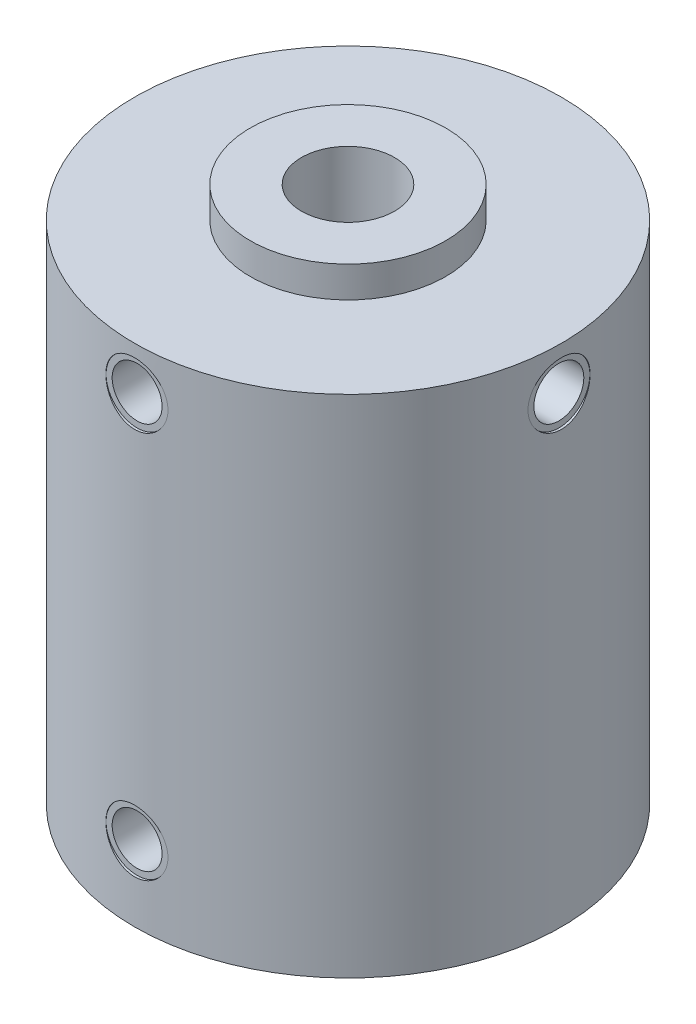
ISO-10303-21;
HEADER;
FILE_DESCRIPTION(('STEP AP214'),'2;1');
FILE_NAME('part.step','',(''),(''),'','','');
FILE_SCHEMA(('AUTOMOTIVE_DESIGN { 1 0 10303 214 1 1 1 1 }'));
ENDSEC;
DATA;
#1=APPLICATION_CONTEXT('core data for automotive mechanical design processes');
#2=APPLICATION_PROTOCOL_DEFINITION('international standard','automotive_design',2000,#1);
#3=PRODUCT_CONTEXT('',#1,'mechanical');
#4=PRODUCT('Part','Part','',(#3));
#5=PRODUCT_RELATED_PRODUCT_CATEGORY('part','',(#4));
#6=PRODUCT_DEFINITION_FORMATION('','',#4);
#7=PRODUCT_DEFINITION_CONTEXT('part definition',#1,'design');
#8=PRODUCT_DEFINITION('design','',#6,#7);
#9=PRODUCT_DEFINITION_SHAPE('','',#8);
#10=(LENGTH_UNIT() NAMED_UNIT(*) SI_UNIT(.MILLI.,.METRE.));
#11=(NAMED_UNIT(*) PLANE_ANGLE_UNIT() SI_UNIT($,.RADIAN.));
#12=(NAMED_UNIT(*) SI_UNIT($,.STERADIAN.) SOLID_ANGLE_UNIT());
#13=UNCERTAINTY_MEASURE_WITH_UNIT(LENGTH_MEASURE(1.E-05),#10,'distance_accuracy_value','');
#14=(GEOMETRIC_REPRESENTATION_CONTEXT(3) GLOBAL_UNCERTAINTY_ASSIGNED_CONTEXT((#13)) GLOBAL_UNIT_ASSIGNED_CONTEXT((#10,
#11,#12)) REPRESENTATION_CONTEXT('',''));
#15=CARTESIAN_POINT('',(0.,0.,0.));
#16=DIRECTION('',(0.,0.,1.));
#17=DIRECTION('',(1.,0.,0.));
#18=AXIS2_PLACEMENT_3D('',#15,#16,#17);
#19=CARTESIAN_POINT('',(-1.5875,0.,7.9375));
#20=DIRECTION('',(1.,0.,0.));
#21=DIRECTION('',(0.,1.,0.));
#22=AXIS2_PLACEMENT_3D('',#19,#20,#21);
#23=PLANE('',#22);
#24=DIRECTION('',(0.,0.,1.));
#25=VECTOR('',#24,1.);
#26=CARTESIAN_POINT('',(-1.5875,9.61903002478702,21.5646));
#27=LINE('',#26,#25);
#28=CARTESIAN_POINT('',(-1.5875,9.61903002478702,6.14836106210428));
#29=VERTEX_POINT('',#28);
#30=CARTESIAN_POINT('',(-1.5875,9.61903002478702,7.9375));
#31=VERTEX_POINT('',#30);
#32=EDGE_CURVE('E274',#29,#31,#27,.T.);
#33=ORIENTED_EDGE('',*,*,#32,.F.);
#34=DIRECTION('',(0.,-1.,0.));
#35=VECTOR('',#34,1.);
#36=CARTESIAN_POINT('',(-1.5875,20.828,6.14836106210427));
#37=LINE('',#36,#35);
#38=CARTESIAN_POINT('',(-1.5875,20.828,6.14836106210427));
#39=VERTEX_POINT('',#38);
#40=EDGE_CURVE('E172',#29,#39,#37,.F.);
#41=ORIENTED_EDGE('',*,*,#40,.T.);
#42=DIRECTION('',(0.,0.,1.));
#43=VECTOR('',#42,1.);
#44=CARTESIAN_POINT('',(-1.5875,20.828,0.));
#45=LINE('',#44,#43);
#46=CARTESIAN_POINT('',(-1.5875,20.828,3.81));
#47=VERTEX_POINT('',#46);
#48=EDGE_CURVE('E203',#47,#39,#45,.T.);
#49=ORIENTED_EDGE('',*,*,#48,.F.);
#50=DIRECTION('',(0.,-1.,0.));
#51=VECTOR('',#50,1.);
#52=CARTESIAN_POINT('',(-1.5875,0.,3.81));
#53=LINE('',#52,#51);
#54=CARTESIAN_POINT('',(-1.5875,21.336,3.81));
#55=VERTEX_POINT('',#54);
#56=EDGE_CURVE('E65',#55,#47,#53,.T.);
#57=ORIENTED_EDGE('',*,*,#56,.F.);
#58=DIRECTION('',(0.,0.,-1.));
#59=VECTOR('',#58,1.);
#60=CARTESIAN_POINT('',(-1.5875,21.336,7.9375));
#61=LINE('',#60,#59);
#62=CARTESIAN_POINT('',(-1.5875,21.336,7.9375));
#63=VERTEX_POINT('',#62);
#64=EDGE_CURVE('E158',#63,#55,#61,.T.);
#65=ORIENTED_EDGE('',*,*,#64,.F.);
#66=DIRECTION('',(0.,-1.,0.));
#67=VECTOR('',#66,1.);
#68=CARTESIAN_POINT('',(-1.5875,0.,7.9375));
#69=LINE('',#68,#67);
#70=EDGE_CURVE('E144',#63,#31,#69,.T.);
#71=ORIENTED_EDGE('',*,*,#70,.T.);
#72=EDGE_LOOP('',(#33,#41,#49,#57,#65,#71));
#73=FACE_BOUND('',#72,.T.);
#74=ADVANCED_FACE('F38',(#73),#23,.T.);
#75=CARTESIAN_POINT('',(1.5875,0.,7.9375));
#76=DIRECTION('',(-1.,0.,0.));
#77=DIRECTION('',(0.,0.,1.));
#78=AXIS2_PLACEMENT_3D('',#75,#76,#77);
#79=PLANE('',#78);
#80=DIRECTION('',(0.,0.,1.));
#81=VECTOR('',#80,1.);
#82=CARTESIAN_POINT('',(1.5875,5.62096997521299,21.5646));
#83=LINE('',#82,#81);
#84=CARTESIAN_POINT('',(1.5875,5.62096997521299,6.14836106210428));
#85=VERTEX_POINT('',#84);
#86=CARTESIAN_POINT('',(1.5875,5.62096997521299,7.9375));
#87=VERTEX_POINT('',#86);
#88=EDGE_CURVE('E57',#85,#87,#83,.T.);
#89=ORIENTED_EDGE('',*,*,#88,.F.);
#90=DIRECTION('',(0.,-1.,0.));
#91=VECTOR('',#90,1.);
#92=CARTESIAN_POINT('',(1.5875,20.828,6.14836106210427));
#93=LINE('',#92,#91);
#94=CARTESIAN_POINT('',(1.5875,0.,6.14836106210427));
#95=VERTEX_POINT('',#94);
#96=EDGE_CURVE('E168',#85,#95,#93,.T.);
#97=ORIENTED_EDGE('',*,*,#96,.T.);
#98=DIRECTION('',(0.,0.,-1.));
#99=VECTOR('',#98,1.);
#100=CARTESIAN_POINT('',(1.5875,0.,7.9375));
#101=LINE('',#100,#99);
#102=CARTESIAN_POINT('',(1.5875,0.,7.9375));
#103=VERTEX_POINT('',#102);
#104=EDGE_CURVE('E163',#103,#95,#101,.T.);
#105=ORIENTED_EDGE('',*,*,#104,.F.);
#106=DIRECTION('',(0.,1.,0.));
#107=VECTOR('',#106,1.);
#108=CARTESIAN_POINT('',(1.5875,0.,7.9375));
#109=LINE('',#108,#107);
#110=EDGE_CURVE('E154',#103,#87,#109,.T.);
#111=ORIENTED_EDGE('',*,*,#110,.T.);
#112=EDGE_LOOP('',(#89,#97,#105,#111));
#113=FACE_BOUND('',#112,.T.);
#114=ADVANCED_FACE('F236',(#113),#79,.T.);
#115=CARTESIAN_POINT('',(-1.5875,21.336,7.9375));
#116=DIRECTION('',(0.,0.,-1.));
#117=DIRECTION('',(-1.,0.,0.));
#118=AXIS2_PLACEMENT_3D('',#115,#116,#117);
#119=PLANE('',#118);
#120=CARTESIAN_POINT('',(0.,7.62,7.9375));
#121=DIRECTION('',(0.,0.,-1.));
#122=DIRECTION('',(-1.,0.,0.));
#123=AXIS2_PLACEMENT_3D('',#120,#121,#122);
#124=CIRCLE('',#123,2.5527);
#125=CARTESIAN_POINT('',(1.5875,9.61903002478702,7.9375));
#126=VERTEX_POINT('',#125);
#127=EDGE_CURVE('E129',#31,#126,#124,.T.);
#128=ORIENTED_EDGE('',*,*,#127,.F.);
#129=ORIENTED_EDGE('',*,*,#70,.F.);
#130=DIRECTION('',(-1.,0.,0.));
#131=VECTOR('',#130,1.);
#132=CARTESIAN_POINT('',(-1.5875,21.336,7.9375));
#133=LINE('',#132,#131);
#134=CARTESIAN_POINT('',(1.5875,21.336,7.9375));
#135=VERTEX_POINT('',#134);
#136=EDGE_CURVE('E156',#135,#63,#133,.T.);
#137=ORIENTED_EDGE('',*,*,#136,.F.);
#138=EDGE_CURVE('E153',#126,#135,#109,.T.);
#139=ORIENTED_EDGE('',*,*,#138,.F.);
#140=EDGE_LOOP('',(#128,#129,#137,#139));
#141=FACE_BOUND('',#140,.T.);
#142=ADVANCED_FACE('F228',(#141),#119,.T.);
#143=CARTESIAN_POINT('',(0.,54.864,0.));
#144=DIRECTION('',(0.,-1.,0.));
#145=DIRECTION('',(0.,0.,-1.));
#146=AXIS2_PLACEMENT_3D('',#143,#144,#145);
#147=CYLINDRICAL_SURFACE('',#146,21.8186);
#148=CARTESIAN_POINT('',(21.5863540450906,47.244,-3.175));
#149=CARTESIAN_POINT('',(21.5863569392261,47.0666747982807,-3.17499263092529));
#150=CARTESIAN_POINT('',(21.5885626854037,46.8892451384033,-3.16009424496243));
#151=CARTESIAN_POINT('',(21.5971418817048,46.5393421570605,-3.10090765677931));
#152=CARTESIAN_POINT('',(21.6035194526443,46.3668739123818,-3.05659039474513));
#153=CARTESIAN_POINT('',(21.6197050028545,46.0320094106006,-2.93991621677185));
#154=CARTESIAN_POINT('',(21.629510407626,45.8696057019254,-2.86758034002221));
#155=CARTESIAN_POINT('',(21.6514437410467,45.5592656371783,-2.69697101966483));
#156=CARTESIAN_POINT('',(21.663571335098,45.4113272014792,-2.59870131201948));
#157=CARTESIAN_POINT('',(21.6888848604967,45.1329771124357,-2.37822200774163));
#158=CARTESIAN_POINT('',(21.7020773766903,45.0026903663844,-2.255855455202));
#159=CARTESIAN_POINT('',(21.7279754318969,44.7644237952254,-1.99099477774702));
#160=CARTESIAN_POINT('',(21.7406809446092,44.6564451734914,-1.84849956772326));
#161=CARTESIAN_POINT('',(21.7642420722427,44.4654013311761,-1.54662889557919));
#162=CARTESIAN_POINT('',(21.7750890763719,44.3824507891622,-1.38718012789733));
#163=CARTESIAN_POINT('',(21.7936381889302,44.2445534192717,-1.05642956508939));
#164=CARTESIAN_POINT('',(21.8013404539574,44.1896051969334,-0.885128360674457));
#165=CARTESIAN_POINT('',(21.8126858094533,44.1096499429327,-0.536820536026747));
#166=CARTESIAN_POINT('',(21.8163572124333,44.0844339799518,-0.359862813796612));
#167=CARTESIAN_POINT('',(21.8193241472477,44.0640105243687,-0.00419228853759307));
#168=CARTESIAN_POINT('',(21.8186199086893,44.068801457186,0.174520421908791));
#169=CARTESIAN_POINT('',(21.8129375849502,44.1080904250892,0.52720323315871));
#170=CARTESIAN_POINT('',(21.8079918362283,44.1423636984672,0.701198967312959));
#171=CARTESIAN_POINT('',(21.7944182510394,44.2392919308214,1.04094294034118));
#172=CARTESIAN_POINT('',(21.7857903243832,44.301947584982,1.20669097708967));
#173=CARTESIAN_POINT('',(21.7657661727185,44.4540938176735,1.52591785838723));
#174=CARTESIAN_POINT('',(21.7543601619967,44.543679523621,1.67935072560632));
#175=CARTESIAN_POINT('',(21.7300519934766,44.7470734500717,1.9690904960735));
#176=CARTESIAN_POINT('',(21.7171497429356,44.8608831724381,2.10539633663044));
#177=CARTESIAN_POINT('',(21.6911479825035,45.1107479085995,2.35833690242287));
#178=CARTESIAN_POINT('',(21.6780477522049,45.2469990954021,2.4747778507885));
#179=CARTESIAN_POINT('',(21.6532432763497,45.5372111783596,2.68317151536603));
#180=CARTESIAN_POINT('',(21.6415390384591,45.6911721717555,2.77512409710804));
#181=CARTESIAN_POINT('',(21.6208520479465,46.0126298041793,2.93195408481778));
#182=CARTESIAN_POINT('',(21.6118712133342,46.1801358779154,2.99681242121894));
#183=CARTESIAN_POINT('',(21.5976824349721,46.5238230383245,3.0974223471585));
#184=CARTESIAN_POINT('',(21.5924742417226,46.7000035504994,3.13317586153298));
#185=CARTESIAN_POINT('',(21.5864674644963,47.0543168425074,3.17429723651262));
#186=CARTESIAN_POINT('',(21.5856290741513,47.2324171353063,3.17993940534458));
#187=CARTESIAN_POINT('',(21.5883512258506,47.5870206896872,3.16140500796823));
#188=CARTESIAN_POINT('',(21.5919116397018,47.7635239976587,3.13722931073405));
#189=CARTESIAN_POINT('',(21.6029937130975,48.1090788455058,3.05997777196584));
#190=CARTESIAN_POINT('',(21.6104967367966,48.2781614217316,3.00703785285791));
#191=CARTESIAN_POINT('',(21.628603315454,48.6050524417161,2.87390174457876));
#192=CARTESIAN_POINT('',(21.6392070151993,48.762860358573,2.79370428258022));
#193=CARTESIAN_POINT('',(21.6624142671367,49.0639543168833,2.60766759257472));
#194=CARTESIAN_POINT('',(21.6750314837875,49.2071292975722,2.50165035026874));
#195=CARTESIAN_POINT('',(21.700802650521,49.4737531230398,2.26723180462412));
#196=CARTESIAN_POINT('',(21.7139566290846,49.5972009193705,2.13882931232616));
#197=CARTESIAN_POINT('',(21.7394432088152,49.8218471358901,1.8620789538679));
#198=CARTESIAN_POINT('',(21.7517685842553,49.9228640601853,1.71358299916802));
#199=CARTESIAN_POINT('',(21.7740977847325,50.0985182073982,1.40157039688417));
#200=CARTESIAN_POINT('',(21.7841016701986,50.1731561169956,1.23805414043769));
#201=CARTESIAN_POINT('',(21.8006289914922,50.2936416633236,0.901216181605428));
#202=CARTESIAN_POINT('',(21.8071645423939,50.3395896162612,0.727930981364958));
#203=CARTESIAN_POINT('',(21.8160695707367,50.40171596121,0.376002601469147));
#204=CARTESIAN_POINT('',(21.818439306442,50.4178961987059,0.197359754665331));
#205=CARTESIAN_POINT('',(21.8187433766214,50.4199848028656,-0.158450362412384));
#206=CARTESIAN_POINT('',(21.8167184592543,50.4061712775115,-0.335616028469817));
#207=CARTESIAN_POINT('',(21.8085426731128,50.3492592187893,-0.685077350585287));
#208=CARTESIAN_POINT('',(21.8023918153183,50.3061607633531,-0.857373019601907));
#209=CARTESIAN_POINT('',(21.786652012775,50.191998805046,-1.19213471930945));
#210=CARTESIAN_POINT('',(21.7770652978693,50.1209534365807,-1.3546070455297));
#211=CARTESIAN_POINT('',(21.7555083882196,49.9529437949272,-1.66536847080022));
#212=CARTESIAN_POINT('',(21.7435381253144,49.8559787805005,-1.81365716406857));
#213=CARTESIAN_POINT('',(21.7184138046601,49.6378720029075,-2.09325470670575));
#214=CARTESIAN_POINT('',(21.7052502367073,49.5165245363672,-2.22440225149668));
#215=CARTESIAN_POINT('',(21.6792944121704,49.2535299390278,-2.46457519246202));
#216=CARTESIAN_POINT('',(21.6665022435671,49.1118780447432,-2.57359538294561));
#217=CARTESIAN_POINT('',(21.6426654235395,48.8114211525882,-2.76693084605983));
#218=CARTESIAN_POINT('',(21.6316303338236,48.6525297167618,-2.85111293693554));
#219=CARTESIAN_POINT('',(21.6126691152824,48.3227803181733,-2.99147115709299));
#220=CARTESIAN_POINT('',(21.6047397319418,48.1519351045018,-3.04767662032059));
#221=CARTESIAN_POINT('',(21.5947378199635,47.8575824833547,-3.11759447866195));
#222=CARTESIAN_POINT('',(21.591610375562,47.7359011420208,-3.13908899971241));
#223=CARTESIAN_POINT('',(21.5874174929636,47.4908300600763,-3.16779424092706));
#224=CARTESIAN_POINT('',(21.5863520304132,47.3674403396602,-3.17500512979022));
#225=CARTESIAN_POINT('',(21.5863540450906,47.244,-3.175));
#226=B_SPLINE_CURVE_WITH_KNOTS('',3,(#148,#149,#150,#151,#152,#153,#154,#155,#156,#157,#158,
#159,#160,#161,#162,#163,#164,#165,#166,#167,#168,#169,#170,#171,#172,#173,#174,#175,#176,#177,
#178,#179,#180,#181,#182,#183,#184,#185,#186,#187,#188,#189,#190,#191,#192,#193,#194,#195,#196,
#197,#198,#199,#200,#201,#202,#203,#204,#205,#206,#207,#208,#209,#210,#211,#212,#213,#214,#215,
#216,#217,#218,#219,#220,#221,#222,#223,#224,#225),.UNSPECIFIED.,.T.,.F.,(4,2,2,2,2,2,2,2,2,2,2,
2,2,2,2,2,2,2,2,2,2,2,2,2,2,2,2,2,2,2,2,2,2,2,2,2,2,2,4),(0.,0.531524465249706,1.06357475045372,
1.59522629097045,2.12680128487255,2.66196062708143,3.1971488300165,3.73475327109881,
4.27233093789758,4.80610804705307,5.33985714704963,5.86957285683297,6.39930154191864,
6.9309238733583,7.46257917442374,7.99915603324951,8.53573583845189,9.07269266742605,
9.6096139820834,10.1416355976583,10.673641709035,11.2031554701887,11.7326939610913,
12.2659921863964,12.7993187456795,13.3368149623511,13.8742971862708,14.409889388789,
14.9454483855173,15.4760627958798,16.0066757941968,16.5369450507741,17.0672294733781,
17.6021911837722,18.1372786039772,18.6751850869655,19.2125263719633,19.5825377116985,
19.9525446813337),.UNSPECIFIED.);
#227=CARTESIAN_POINT('',(21.5863540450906,47.244,-3.175));
#228=VERTEX_POINT('',#227);
#229=EDGE_CURVE('E50',#228,#228,#226,.T.);
#230=ORIENTED_EDGE('',*,*,#229,.T.);
#231=EDGE_LOOP('',(#230));
#232=FACE_BOUND('',#231,.T.);
#233=CARTESIAN_POINT('',(3.175,47.244,21.5863540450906));
#234=CARTESIAN_POINT('',(3.17499263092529,47.0666747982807,21.5863569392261));
#235=CARTESIAN_POINT('',(3.16009424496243,46.8892451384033,21.5885626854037));
#236=CARTESIAN_POINT('',(3.10090765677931,46.5393421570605,21.5971418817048));
#237=CARTESIAN_POINT('',(3.05659039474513,46.3668739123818,21.6035194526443));
#238=CARTESIAN_POINT('',(2.93991621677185,46.0320094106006,21.6197050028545));
#239=CARTESIAN_POINT('',(2.86758034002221,45.8696057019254,21.629510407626));
#240=CARTESIAN_POINT('',(2.69697101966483,45.5592656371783,21.6514437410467));
#241=CARTESIAN_POINT('',(2.59870131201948,45.4113272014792,21.663571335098));
#242=CARTESIAN_POINT('',(2.37822200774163,45.1329771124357,21.6888848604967));
#243=CARTESIAN_POINT('',(2.255855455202,45.0026903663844,21.7020773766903));
#244=CARTESIAN_POINT('',(1.99099477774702,44.7644237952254,21.7279754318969));
#245=CARTESIAN_POINT('',(1.84849956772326,44.6564451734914,21.7406809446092));
#246=CARTESIAN_POINT('',(1.54662889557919,44.4654013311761,21.7642420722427));
#247=CARTESIAN_POINT('',(1.38718012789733,44.3824507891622,21.7750890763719));
#248=CARTESIAN_POINT('',(1.05642956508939,44.2445534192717,21.7936381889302));
#249=CARTESIAN_POINT('',(0.885128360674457,44.1896051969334,21.8013404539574));
#250=CARTESIAN_POINT('',(0.536820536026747,44.1096499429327,21.8126858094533));
#251=CARTESIAN_POINT('',(0.359862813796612,44.0844339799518,21.8163572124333));
#252=CARTESIAN_POINT('',(0.00419228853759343,44.0640105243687,21.8193241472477));
#253=CARTESIAN_POINT('',(-0.174520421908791,44.068801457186,21.8186199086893));
#254=CARTESIAN_POINT('',(-0.52720323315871,44.1080904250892,21.8129375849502));
#255=CARTESIAN_POINT('',(-0.701198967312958,44.1423636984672,21.8079918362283));
#256=CARTESIAN_POINT('',(-1.04094294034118,44.2392919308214,21.7944182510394));
#257=CARTESIAN_POINT('',(-1.20669097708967,44.301947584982,21.7857903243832));
#258=CARTESIAN_POINT('',(-1.52591785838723,44.4540938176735,21.7657661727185));
#259=CARTESIAN_POINT('',(-1.67935072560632,44.543679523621,21.7543601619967));
#260=CARTESIAN_POINT('',(-1.9690904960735,44.7470734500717,21.7300519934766));
#261=CARTESIAN_POINT('',(-2.10539633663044,44.8608831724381,21.7171497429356));
#262=CARTESIAN_POINT('',(-2.35833690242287,45.1107479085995,21.6911479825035));
#263=CARTESIAN_POINT('',(-2.4747778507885,45.2469990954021,21.6780477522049));
#264=CARTESIAN_POINT('',(-2.68317151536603,45.5372111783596,21.6532432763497));
#265=CARTESIAN_POINT('',(-2.77512409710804,45.6911721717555,21.6415390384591));
#266=CARTESIAN_POINT('',(-2.93195408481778,46.0126298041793,21.6208520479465));
#267=CARTESIAN_POINT('',(-2.99681242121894,46.1801358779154,21.6118712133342));
#268=CARTESIAN_POINT('',(-3.0974223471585,46.5238230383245,21.5976824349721));
#269=CARTESIAN_POINT('',(-3.13317586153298,46.7000035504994,21.5924742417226));
#270=CARTESIAN_POINT('',(-3.17429723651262,47.0543168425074,21.5864674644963));
#271=CARTESIAN_POINT('',(-3.17993940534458,47.2324171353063,21.5856290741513));
#272=CARTESIAN_POINT('',(-3.16140500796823,47.5870206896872,21.5883512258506));
#273=CARTESIAN_POINT('',(-3.13722931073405,47.7635239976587,21.5919116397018));
#274=CARTESIAN_POINT('',(-3.05997777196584,48.1090788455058,21.6029937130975));
#275=CARTESIAN_POINT('',(-3.00703785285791,48.2781614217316,21.6104967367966));
#276=CARTESIAN_POINT('',(-2.87390174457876,48.6050524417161,21.628603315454));
#277=CARTESIAN_POINT('',(-2.79370428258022,48.762860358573,21.6392070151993));
#278=CARTESIAN_POINT('',(-2.60766759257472,49.0639543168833,21.6624142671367));
#279=CARTESIAN_POINT('',(-2.50165035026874,49.2071292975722,21.6750314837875));
#280=CARTESIAN_POINT('',(-2.26723180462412,49.4737531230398,21.700802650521));
#281=CARTESIAN_POINT('',(-2.13882931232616,49.5972009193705,21.7139566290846));
#282=CARTESIAN_POINT('',(-1.8620789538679,49.8218471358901,21.7394432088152));
#283=CARTESIAN_POINT('',(-1.71358299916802,49.9228640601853,21.7517685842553));
#284=CARTESIAN_POINT('',(-1.40157039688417,50.0985182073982,21.7740977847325));
#285=CARTESIAN_POINT('',(-1.23805414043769,50.1731561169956,21.7841016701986));
#286=CARTESIAN_POINT('',(-0.901216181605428,50.2936416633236,21.8006289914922));
#287=CARTESIAN_POINT('',(-0.727930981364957,50.3395896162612,21.8071645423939));
#288=CARTESIAN_POINT('',(-0.376002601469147,50.40171596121,21.8160695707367));
#289=CARTESIAN_POINT('',(-0.197359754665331,50.4178961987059,21.818439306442));
#290=CARTESIAN_POINT('',(0.158450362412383,50.4199848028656,21.8187433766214));
#291=CARTESIAN_POINT('',(0.335616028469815,50.4061712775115,21.8167184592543));
#292=CARTESIAN_POINT('',(0.685077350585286,50.3492592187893,21.8085426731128));
#293=CARTESIAN_POINT('',(0.857373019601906,50.3061607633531,21.8023918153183));
#294=CARTESIAN_POINT('',(1.19213471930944,50.191998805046,21.786652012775));
#295=CARTESIAN_POINT('',(1.3546070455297,50.1209534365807,21.7770652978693));
#296=CARTESIAN_POINT('',(1.66536847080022,49.9529437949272,21.7555083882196));
#297=CARTESIAN_POINT('',(1.81365716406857,49.8559787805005,21.7435381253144));
#298=CARTESIAN_POINT('',(2.09325470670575,49.6378720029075,21.7184138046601));
#299=CARTESIAN_POINT('',(2.22440225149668,49.5165245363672,21.7052502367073));
#300=CARTESIAN_POINT('',(2.46457519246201,49.2535299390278,21.6792944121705));
#301=CARTESIAN_POINT('',(2.57359538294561,49.1118780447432,21.6665022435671));
#302=CARTESIAN_POINT('',(2.76693084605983,48.8114211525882,21.6426654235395));
#303=CARTESIAN_POINT('',(2.85111293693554,48.6525297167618,21.6316303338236));
#304=CARTESIAN_POINT('',(2.99147115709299,48.3227803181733,21.6126691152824));
#305=CARTESIAN_POINT('',(3.04767662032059,48.1519351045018,21.6047397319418));
#306=CARTESIAN_POINT('',(3.11759447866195,47.8575824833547,21.5947378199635));
#307=CARTESIAN_POINT('',(3.13908899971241,47.7359011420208,21.591610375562));
#308=CARTESIAN_POINT('',(3.16779424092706,47.4908300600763,21.5874174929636));
#309=CARTESIAN_POINT('',(3.17500512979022,47.3674403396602,21.5863520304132));
#310=CARTESIAN_POINT('',(3.175,47.244,21.5863540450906));
#311=B_SPLINE_CURVE_WITH_KNOTS('',3,(#233,#234,#235,#236,#237,#238,#239,#240,#241,#242,#243,
#244,#245,#246,#247,#248,#249,#250,#251,#252,#253,#254,#255,#256,#257,#258,#259,#260,#261,#262,
#263,#264,#265,#266,#267,#268,#269,#270,#271,#272,#273,#274,#275,#276,#277,#278,#279,#280,#281,
#282,#283,#284,#285,#286,#287,#288,#289,#290,#291,#292,#293,#294,#295,#296,#297,#298,#299,#300,
#301,#302,#303,#304,#305,#306,#307,#308,#309,#310),.UNSPECIFIED.,.T.,.F.,(4,2,2,2,2,2,2,2,2,2,2,
2,2,2,2,2,2,2,2,2,2,2,2,2,2,2,2,2,2,2,2,2,2,2,2,2,2,2,4),(0.,0.531524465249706,1.06357475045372,
1.59522629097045,2.12680128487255,2.66196062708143,3.1971488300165,3.73475327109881,
4.27233093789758,4.80610804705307,5.33985714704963,5.86957285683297,6.39930154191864,
6.9309238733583,7.46257917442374,7.99915603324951,8.53573583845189,9.07269266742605,
9.6096139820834,10.1416355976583,10.673641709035,11.2031554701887,11.7326939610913,
12.2659921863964,12.7993187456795,13.3368149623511,13.8742971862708,14.409889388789,
14.9454483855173,15.4760627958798,16.0066757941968,16.5369450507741,17.0672294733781,
17.6021911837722,18.1372786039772,18.6751850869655,19.2125263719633,19.5825377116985,
19.9525446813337),.UNSPECIFIED.);
#312=CARTESIAN_POINT('',(3.175,47.244,21.5863540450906));
#313=VERTEX_POINT('',#312);
#314=EDGE_CURVE('E206',#313,#313,#311,.T.);
#315=ORIENTED_EDGE('',*,*,#314,.T.);
#316=EDGE_LOOP('',(#315));
#317=FACE_BOUND('',#316,.T.);
#318=CARTESIAN_POINT('',(0.,51.689,0.));
#319=DIRECTION('',(0.,-1.,0.));
#320=DIRECTION('',(0.,0.,-1.));
#321=AXIS2_PLACEMENT_3D('',#318,#319,#320);
#322=CIRCLE('',#321,21.8186);
#323=CARTESIAN_POINT('',(0.,51.689,-21.8186));
#324=VERTEX_POINT('',#323);
#325=EDGE_CURVE('E180',#324,#324,#322,.T.);
#326=ORIENTED_EDGE('',*,*,#325,.T.);
#327=EDGE_LOOP('',(#326));
#328=FACE_BOUND('',#327,.T.);
#329=CARTESIAN_POINT('',(0.,0.,0.));
#330=DIRECTION('',(0.,1.,0.));
#331=DIRECTION('',(0.,0.,1.));
#332=AXIS2_PLACEMENT_3D('',#329,#330,#331);
#333=CIRCLE('',#332,21.8186);
#334=CARTESIAN_POINT('',(0.,0.,21.8186));
#335=VERTEX_POINT('',#334);
#336=EDGE_CURVE('E193',#335,#335,#333,.T.);
#337=ORIENTED_EDGE('',*,*,#336,.T.);
#338=EDGE_LOOP('',(#337));
#339=FACE_BOUND('',#338,.T.);
#340=CARTESIAN_POINT('',(3.175,7.62,21.5863540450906));
#341=CARTESIAN_POINT('',(3.17499263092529,7.79732520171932,21.5863569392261));
#342=CARTESIAN_POINT('',(3.16009424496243,7.97475486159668,21.5885626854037));
#343=CARTESIAN_POINT('',(3.10090765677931,8.32465784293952,21.5971418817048));
#344=CARTESIAN_POINT('',(3.05659039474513,8.49712608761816,21.6035194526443));
#345=CARTESIAN_POINT('',(2.93991621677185,8.83199058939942,21.6197050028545));
#346=CARTESIAN_POINT('',(2.86758034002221,8.99439429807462,21.629510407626));
#347=CARTESIAN_POINT('',(2.69697101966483,9.30473436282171,21.6514437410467));
#348=CARTESIAN_POINT('',(2.59870131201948,9.4526727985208,21.663571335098));
#349=CARTESIAN_POINT('',(2.37822200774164,9.73102288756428,21.6888848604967));
#350=CARTESIAN_POINT('',(2.255855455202,9.86130963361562,21.7020773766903));
#351=CARTESIAN_POINT('',(1.99099477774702,10.0995762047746,21.7279754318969));
#352=CARTESIAN_POINT('',(1.84849956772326,10.2075548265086,21.7406809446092));
#353=CARTESIAN_POINT('',(1.54662889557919,10.3985986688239,21.7642420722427));
#354=CARTESIAN_POINT('',(1.38718012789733,10.4815492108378,21.7750890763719));
#355=CARTESIAN_POINT('',(1.05642956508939,10.6194465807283,21.7936381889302));
#356=CARTESIAN_POINT('',(0.88512836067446,10.6743948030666,21.8013404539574));
#357=CARTESIAN_POINT('',(0.536820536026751,10.7543500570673,21.8126858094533));
#358=CARTESIAN_POINT('',(0.359862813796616,10.7795660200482,21.8163572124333));
#359=CARTESIAN_POINT('',(0.0041922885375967,10.7999894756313,21.8193241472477));
#360=CARTESIAN_POINT('',(-0.174520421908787,10.795198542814,21.8186199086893));
#361=CARTESIAN_POINT('',(-0.527203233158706,10.7559095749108,21.8129375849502));
#362=CARTESIAN_POINT('',(-0.701198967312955,10.7216363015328,21.8079918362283));
#363=CARTESIAN_POINT('',(-1.04094294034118,10.6247080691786,21.7944182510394));
#364=CARTESIAN_POINT('',(-1.20669097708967,10.562052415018,21.7857903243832));
#365=CARTESIAN_POINT('',(-1.52591785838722,10.4099061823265,21.7657661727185));
#366=CARTESIAN_POINT('',(-1.67935072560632,10.320320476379,21.7543601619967));
#367=CARTESIAN_POINT('',(-1.9690904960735,10.1169265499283,21.7300519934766));
#368=CARTESIAN_POINT('',(-2.10539633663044,10.0031168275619,21.7171497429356));
#369=CARTESIAN_POINT('',(-2.35833690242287,9.75325209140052,21.6911479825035));
#370=CARTESIAN_POINT('',(-2.47477785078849,9.6170009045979,21.6780477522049));
#371=CARTESIAN_POINT('',(-2.68317151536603,9.32678882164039,21.6532432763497));
#372=CARTESIAN_POINT('',(-2.77512409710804,9.1728278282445,21.6415390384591));
#373=CARTESIAN_POINT('',(-2.93195408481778,8.85137019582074,21.6208520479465));
#374=CARTESIAN_POINT('',(-2.99681242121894,8.68386412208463,21.6118712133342));
#375=CARTESIAN_POINT('',(-3.0974223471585,8.34017696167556,21.5976824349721));
#376=CARTESIAN_POINT('',(-3.13317586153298,8.16399644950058,21.5924742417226));
#377=CARTESIAN_POINT('',(-3.17429723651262,7.80968315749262,21.5864674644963));
#378=CARTESIAN_POINT('',(-3.17993940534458,7.6315828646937,21.5856290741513));
#379=CARTESIAN_POINT('',(-3.16140500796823,7.27697931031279,21.5883512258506));
#380=CARTESIAN_POINT('',(-3.13722931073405,7.10047600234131,21.5919116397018));
#381=CARTESIAN_POINT('',(-3.05997777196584,6.75492115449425,21.6029937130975));
#382=CARTESIAN_POINT('',(-3.00703785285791,6.58583857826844,21.6104967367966));
#383=CARTESIAN_POINT('',(-2.87390174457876,6.25894755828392,21.628603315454));
#384=CARTESIAN_POINT('',(-2.79370428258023,6.10113964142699,21.6392070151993));
#385=CARTESIAN_POINT('',(-2.60766759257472,5.80004568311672,21.6624142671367));
#386=CARTESIAN_POINT('',(-2.50165035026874,5.65687070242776,21.6750314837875));
#387=CARTESIAN_POINT('',(-2.26723180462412,5.39024687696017,21.700802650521));
#388=CARTESIAN_POINT('',(-2.13882931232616,5.26679908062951,21.7139566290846));
#389=CARTESIAN_POINT('',(-1.8620789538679,5.04215286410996,21.7394432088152));
#390=CARTESIAN_POINT('',(-1.71358299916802,4.9411359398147,21.7517685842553));
#391=CARTESIAN_POINT('',(-1.40157039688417,4.76548179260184,21.7740977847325));
#392=CARTESIAN_POINT('',(-1.2380541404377,4.69084388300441,21.7841016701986));
#393=CARTESIAN_POINT('',(-0.901216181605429,4.57035833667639,21.8006289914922));
#394=CARTESIAN_POINT('',(-0.72793098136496,4.52441038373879,21.8071645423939));
#395=CARTESIAN_POINT('',(-0.37600260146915,4.46228403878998,21.8160695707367));
#396=CARTESIAN_POINT('',(-0.197359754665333,4.44610380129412,21.818439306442));
#397=CARTESIAN_POINT('',(0.158450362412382,4.44401519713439,21.8187433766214));
#398=CARTESIAN_POINT('',(0.335616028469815,4.45782872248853,21.8167184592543));
#399=CARTESIAN_POINT('',(0.685077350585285,4.51474078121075,21.8085426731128));
#400=CARTESIAN_POINT('',(0.857373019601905,4.55783923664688,21.8023918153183));
#401=CARTESIAN_POINT('',(1.19213471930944,4.67200119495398,21.786652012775));
#402=CARTESIAN_POINT('',(1.3546070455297,4.74304656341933,21.7770652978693));
#403=CARTESIAN_POINT('',(1.66536847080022,4.91105620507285,21.7555083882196));
#404=CARTESIAN_POINT('',(1.81365716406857,5.00802121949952,21.7435381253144));
#405=CARTESIAN_POINT('',(2.09325470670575,5.22612799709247,21.7184138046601));
#406=CARTESIAN_POINT('',(2.22440225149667,5.34747546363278,21.7052502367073));
#407=CARTESIAN_POINT('',(2.46457519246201,5.61047006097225,21.6792944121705));
#408=CARTESIAN_POINT('',(2.5735953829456,5.75212195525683,21.6665022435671));
#409=CARTESIAN_POINT('',(2.76693084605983,6.05257884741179,21.6426654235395));
#410=CARTESIAN_POINT('',(2.85111293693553,6.21147028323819,21.6316303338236));
#411=CARTESIAN_POINT('',(2.99147115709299,6.54121968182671,21.6126691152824));
#412=CARTESIAN_POINT('',(3.04767662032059,6.7120648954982,21.6047397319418));
#413=CARTESIAN_POINT('',(3.11759447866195,7.00641751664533,21.5947378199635));
#414=CARTESIAN_POINT('',(3.13908899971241,7.1280988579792,21.591610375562));
#415=CARTESIAN_POINT('',(3.16779424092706,7.37316993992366,21.5874174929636));
#416=CARTESIAN_POINT('',(3.17500512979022,7.49655966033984,21.5863520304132));
#417=CARTESIAN_POINT('',(3.175,7.62,21.5863540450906));
#418=B_SPLINE_CURVE_WITH_KNOTS('',3,(#340,#341,#342,#343,#344,#345,#346,#347,#348,#349,#350,
#351,#352,#353,#354,#355,#356,#357,#358,#359,#360,#361,#362,#363,#364,#365,#366,#367,#368,#369,
#370,#371,#372,#373,#374,#375,#376,#377,#378,#379,#380,#381,#382,#383,#384,#385,#386,#387,#388,
#389,#390,#391,#392,#393,#394,#395,#396,#397,#398,#399,#400,#401,#402,#403,#404,#405,#406,#407,
#408,#409,#410,#411,#412,#413,#414,#415,#416,#417),.UNSPECIFIED.,.T.,.F.,(4,2,2,2,2,2,2,2,2,2,2,
2,2,2,2,2,2,2,2,2,2,2,2,2,2,2,2,2,2,2,2,2,2,2,2,2,2,2,4),(0.,0.531524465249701,1.06357475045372,
1.59522629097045,2.12680128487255,2.66196062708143,3.1971488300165,3.7347532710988,
4.27233093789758,4.80610804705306,5.33985714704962,5.86957285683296,6.39930154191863,
6.93092387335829,7.46257917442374,7.9991560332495,8.53573583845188,9.07269266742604,
9.6096139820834,10.1416355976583,10.673641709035,11.2031554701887,11.7326939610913,
12.2659921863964,12.7993187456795,13.336814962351,13.8742971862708,14.409889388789,
14.9454483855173,15.4760627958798,16.0066757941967,16.536945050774,17.0672294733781,
17.6021911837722,18.1372786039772,18.6751850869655,19.2125263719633,19.5825377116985,
19.9525446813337),.UNSPECIFIED.);
#419=CARTESIAN_POINT('',(3.175,7.62,21.5863540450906));
#420=VERTEX_POINT('',#419);
#421=EDGE_CURVE('E11',#420,#420,#418,.T.);
#422=ORIENTED_EDGE('',*,*,#421,.F.);
#423=EDGE_LOOP('',(#422));
#424=FACE_BOUND('',#423,.T.);
#425=ADVANCED_FACE('F40',(#232,#317,#328,#339,#424),#147,.T.);
#426=CARTESIAN_POINT('',(0.,0.,0.));
#427=DIRECTION('',(0.,1.,0.));
#428=DIRECTION('',(0.,0.,1.));
#429=AXIS2_PLACEMENT_3D('',#426,#427,#428);
#430=PLANE('',#429);
#431=ORIENTED_EDGE('',*,*,#336,.F.);
#432=EDGE_LOOP('',(#431));
#433=FACE_BOUND('',#432,.T.);
#434=DIRECTION('',(0.,0.,-1.));
#435=VECTOR('',#434,1.);
#436=CARTESIAN_POINT('',(-1.5875,0.,7.9375));
#437=LINE('',#436,#435);
#438=CARTESIAN_POINT('',(-1.5875,0.,7.9375));
#439=VERTEX_POINT('',#438);
#440=CARTESIAN_POINT('',(-1.5875,0.,6.14836106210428));
#441=VERTEX_POINT('',#440);
#442=EDGE_CURVE('E166',#439,#441,#437,.T.);
#443=ORIENTED_EDGE('',*,*,#442,.F.);
#444=DIRECTION('',(1.,0.,0.));
#445=VECTOR('',#444,1.);
#446=CARTESIAN_POINT('',(-1.5875,0.,7.9375));
#447=LINE('',#446,#445);
#448=EDGE_CURVE('E142',#439,#103,#447,.T.);
#449=ORIENTED_EDGE('',*,*,#448,.T.);
#450=ORIENTED_EDGE('',*,*,#104,.T.);
#451=CARTESIAN_POINT('',(0.,0.,0.));
#452=DIRECTION('',(0.,-1.,0.));
#453=DIRECTION('',(0.,0.,-1.));
#454=AXIS2_PLACEMENT_3D('',#451,#452,#453);
#455=CIRCLE('',#454,6.35);
#456=EDGE_CURVE('E181',#441,#95,#455,.T.);
#457=ORIENTED_EDGE('',*,*,#456,.F.);
#458=EDGE_LOOP('',(#443,#449,#450,#457));
#459=FACE_BOUND('',#458,.T.);
#460=ADVANCED_FACE('F257',(#433,#459),#430,.F.);
#461=CARTESIAN_POINT('',(0.,20.828,0.));
#462=DIRECTION('',(0.,-1.,0.));
#463=DIRECTION('',(0.,0.,-1.));
#464=AXIS2_PLACEMENT_3D('',#461,#462,#463);
#465=CYLINDRICAL_SURFACE('',#464,6.35);
#466=ORIENTED_EDGE('',*,*,#96,.F.);
#467=CARTESIAN_POINT('',(1.5875,5.62096997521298,6.14836106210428));
#468=CARTESIAN_POINT('',(1.70075909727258,5.71085823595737,6.11914631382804));
#469=CARTESIAN_POINT('',(1.80610769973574,5.81026011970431,6.08857410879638));
#470=CARTESIAN_POINT('',(1.99890352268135,6.02577181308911,6.02802150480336));
#471=CARTESIAN_POINT('',(2.08630321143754,6.141924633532,5.9980428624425));
#472=CARTESIAN_POINT('',(2.24060209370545,6.3882783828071,5.94213680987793));
#473=CARTESIAN_POINT('',(2.30747503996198,6.51849701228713,5.91621460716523));
#474=CARTESIAN_POINT('',(2.41821379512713,6.78941232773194,5.87182445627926));
#475=CARTESIAN_POINT('',(2.46211331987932,6.93009331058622,5.85334559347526));
#476=CARTESIAN_POINT('',(2.52370583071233,7.211380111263,5.82704858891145));
#477=CARTESIAN_POINT('',(2.54248904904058,7.35170452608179,5.8187882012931));
#478=CARTESIAN_POINT('',(2.55656217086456,7.63376488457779,5.81262085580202));
#479=CARTESIAN_POINT('',(2.55185522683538,7.77550063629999,5.81471250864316));
#480=CARTESIAN_POINT('',(2.52024805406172,8.04669883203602,5.82847319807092));
#481=CARTESIAN_POINT('',(2.49478978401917,8.17636562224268,5.83951971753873));
#482=CARTESIAN_POINT('',(2.42451967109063,8.42946879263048,5.86904101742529));
#483=CARTESIAN_POINT('',(2.37970112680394,8.55290299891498,5.88751836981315));
#484=CARTESIAN_POINT('',(2.27046308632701,8.79448886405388,5.9305176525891));
#485=CARTESIAN_POINT('',(2.20546142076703,8.91234442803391,5.95521433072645));
#486=CARTESIAN_POINT('',(2.05820882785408,9.13589793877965,6.00769150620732));
#487=CARTESIAN_POINT('',(1.9759680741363,9.24160299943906,6.03547018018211));
#488=CARTESIAN_POINT('',(1.84012363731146,9.3905612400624,6.07772714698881));
#489=CARTESIAN_POINT('',(1.79215262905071,9.43910022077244,6.09207470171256));
#490=CARTESIAN_POINT('',(1.69253833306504,9.53212452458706,6.12049787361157));
#491=CARTESIAN_POINT('',(1.64090240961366,9.57661758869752,6.13457396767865));
#492=CARTESIAN_POINT('',(1.5875,9.61903002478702,6.14836106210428));
#493=B_SPLINE_CURVE_WITH_KNOTS('',3,(#467,#468,#469,#470,#471,#472,#473,#474,#475,#476,#477,
#478,#479,#480,#481,#482,#483,#484,#485,#486,#487,#488,#489,#490,#491,#492),.UNSPECIFIED.,.F.,
.F.,(4,2,2,2,2,2,2,2,2,2,2,2,4),(0.,0.442047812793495,0.885251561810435,1.3290196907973,
1.77213470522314,2.19531283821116,2.61843418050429,3.01443290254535,3.4105688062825,
3.81940078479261,4.22799216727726,4.43701362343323,4.64562635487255),.UNSPECIFIED.);
#494=CARTESIAN_POINT('',(1.5875,9.61903002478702,6.14836106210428));
#495=VERTEX_POINT('',#494);
#496=EDGE_CURVE('E138',#85,#495,#493,.T.);
#497=ORIENTED_EDGE('',*,*,#496,.T.);
#498=CARTESIAN_POINT('',(1.5875,20.828,6.14836106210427));
#499=VERTEX_POINT('',#498);
#500=EDGE_CURVE('E169',#499,#495,#93,.T.);
#501=ORIENTED_EDGE('',*,*,#500,.F.);
#502=CARTESIAN_POINT('',(0.,20.828,0.));
#503=DIRECTION('',(0.,-1.,0.));
#504=DIRECTION('',(0.,0.,-1.));
#505=AXIS2_PLACEMENT_3D('',#502,#503,#504);
#506=CIRCLE('',#505,6.35);
#507=EDGE_CURVE('E184',#39,#499,#506,.T.);
#508=ORIENTED_EDGE('',*,*,#507,.F.);
#509=ORIENTED_EDGE('',*,*,#40,.F.);
#510=CARTESIAN_POINT('',(-1.5875,9.61903002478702,6.14836106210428));
#511=CARTESIAN_POINT('',(-1.70075909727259,9.52914176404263,6.11914631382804));
#512=CARTESIAN_POINT('',(-1.80610769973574,9.42973988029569,6.08857410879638));
#513=CARTESIAN_POINT('',(-1.99890352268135,9.21422818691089,6.02802150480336));
#514=CARTESIAN_POINT('',(-2.08630321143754,9.098075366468,5.9980428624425));
#515=CARTESIAN_POINT('',(-2.24060209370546,8.8517216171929,5.94213680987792));
#516=CARTESIAN_POINT('',(-2.30747503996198,8.72150298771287,5.91621460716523));
#517=CARTESIAN_POINT('',(-2.41821379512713,8.45058767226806,5.87182445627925));
#518=CARTESIAN_POINT('',(-2.46211331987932,8.30990668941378,5.85334559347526));
#519=CARTESIAN_POINT('',(-2.52370583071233,8.028619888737,5.82704858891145));
#520=CARTESIAN_POINT('',(-2.54248904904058,7.88829547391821,5.8187882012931));
#521=CARTESIAN_POINT('',(-2.55656217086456,7.60623511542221,5.81262085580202));
#522=CARTESIAN_POINT('',(-2.55185522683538,7.46449936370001,5.81471250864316));
#523=CARTESIAN_POINT('',(-2.52024805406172,7.19330116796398,5.82847319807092));
#524=CARTESIAN_POINT('',(-2.49478978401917,7.06363437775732,5.83951971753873));
#525=CARTESIAN_POINT('',(-2.42451967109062,6.81053120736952,5.86904101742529));
#526=CARTESIAN_POINT('',(-2.37970112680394,6.68709700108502,5.88751836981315));
#527=CARTESIAN_POINT('',(-2.27046308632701,6.44551113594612,5.9305176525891));
#528=CARTESIAN_POINT('',(-2.20546142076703,6.3276555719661,5.95521433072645));
#529=CARTESIAN_POINT('',(-2.05820882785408,6.10410206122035,6.00769150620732));
#530=CARTESIAN_POINT('',(-1.9759680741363,5.99839700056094,6.03547018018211));
#531=CARTESIAN_POINT('',(-1.84012363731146,5.8494387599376,6.07772714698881));
#532=CARTESIAN_POINT('',(-1.7921526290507,5.80089977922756,6.09207470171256));
#533=CARTESIAN_POINT('',(-1.69253833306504,5.70787547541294,6.12049787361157));
#534=CARTESIAN_POINT('',(-1.64090240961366,5.66338241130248,6.13457396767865));
#535=CARTESIAN_POINT('',(-1.5875,5.62096997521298,6.14836106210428));
#536=B_SPLINE_CURVE_WITH_KNOTS('',3,(#510,#511,#512,#513,#514,#515,#516,#517,#518,#519,#520,
#521,#522,#523,#524,#525,#526,#527,#528,#529,#530,#531,#532,#533,#534,#535),.UNSPECIFIED.,.F.,
.F.,(4,2,2,2,2,2,2,2,2,2,2,2,4),(0.,0.442047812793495,0.885251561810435,1.3290196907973,
1.77213470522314,2.19531283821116,2.61843418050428,3.01443290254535,3.4105688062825,
3.81940078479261,4.22799216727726,4.43701362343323,4.64562635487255),.UNSPECIFIED.);
#537=CARTESIAN_POINT('',(-1.5875,5.62096997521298,6.14836106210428));
#538=VERTEX_POINT('',#537);
#539=EDGE_CURVE('E268',#29,#538,#536,.T.);
#540=ORIENTED_EDGE('',*,*,#539,.T.);
#541=EDGE_CURVE('E136',#441,#538,#37,.F.);
#542=ORIENTED_EDGE('',*,*,#541,.F.);
#543=ORIENTED_EDGE('',*,*,#456,.T.);
#544=EDGE_LOOP('',(#466,#497,#501,#508,#509,#540,#542,#543));
#545=FACE_BOUND('',#544,.T.);
#546=ADVANCED_FACE('F252',(#545),#465,.F.);
#547=CARTESIAN_POINT('',(0.,20.828,0.));
#548=DIRECTION('',(0.,-1.,0.));
#549=DIRECTION('',(0.,0.,-1.));
#550=AXIS2_PLACEMENT_3D('',#547,#548,#549);
#551=PLANE('',#550);
#552=DIRECTION('',(1.,0.,0.));
#553=VECTOR('',#552,1.);
#554=CARTESIAN_POINT('',(0.,20.828,3.81));
#555=LINE('',#554,#553);
#556=CARTESIAN_POINT('',(1.5875,20.828,3.81));
#557=VERTEX_POINT('',#556);
#558=EDGE_CURVE('E196',#47,#557,#555,.T.);
#559=ORIENTED_EDGE('',*,*,#558,.F.);
#560=ORIENTED_EDGE('',*,*,#48,.T.);
#561=ORIENTED_EDGE('',*,*,#507,.T.);
#562=DIRECTION('',(0.,0.,-1.));
#563=VECTOR('',#562,1.);
#564=CARTESIAN_POINT('',(1.5875,20.828,0.));
#565=LINE('',#564,#563);
#566=EDGE_CURVE('E200',#499,#557,#565,.T.);
#567=ORIENTED_EDGE('',*,*,#566,.T.);
#568=EDGE_LOOP('',(#559,#560,#561,#567));
#569=FACE_BOUND('',#568,.T.);
#570=ADVANCED_FACE('F248',(#569),#551,.T.);
#571=CARTESIAN_POINT('',(0.,51.689,0.));
#572=DIRECTION('',(0.,-1.,0.));
#573=DIRECTION('',(0.,0.,-1.));
#574=AXIS2_PLACEMENT_3D('',#571,#572,#573);
#575=PLANE('',#574);
#576=CARTESIAN_POINT('',(0.,51.689,0.));
#577=DIRECTION('',(0.,-1.,0.));
#578=DIRECTION('',(0.,0.,-1.));
#579=AXIS2_PLACEMENT_3D('',#576,#577,#578);
#580=CIRCLE('',#579,9.9949);
#581=CARTESIAN_POINT('',(0.,51.689,-9.9949));
#582=VERTEX_POINT('',#581);
#583=EDGE_CURVE('E177',#582,#582,#580,.T.);
#584=ORIENTED_EDGE('',*,*,#583,.T.);
#585=EDGE_LOOP('',(#584));
#586=FACE_BOUND('',#585,.T.);
#587=ORIENTED_EDGE('',*,*,#325,.F.);
#588=EDGE_LOOP('',(#587));
#589=FACE_BOUND('',#588,.T.);
#590=ADVANCED_FACE('F244',(#586,#589),#575,.F.);
#591=CARTESIAN_POINT('',(0.,51.689,0.));
#592=DIRECTION('',(0.,1.,0.));
#593=DIRECTION('',(0.,0.,1.));
#594=AXIS2_PLACEMENT_3D('',#591,#592,#593);
#595=CYLINDRICAL_SURFACE('',#594,9.9949);
#596=ORIENTED_EDGE('',*,*,#583,.F.);
#597=EDGE_LOOP('',(#596));
#598=FACE_BOUND('',#597,.T.);
#599=CARTESIAN_POINT('',(0.,54.864,0.));
#600=DIRECTION('',(0.,-1.,0.));
#601=DIRECTION('',(0.,0.,-1.));
#602=AXIS2_PLACEMENT_3D('',#599,#600,#601);
#603=CIRCLE('',#602,9.9949);
#604=CARTESIAN_POINT('',(0.,54.864,-9.9949));
#605=VERTEX_POINT('',#604);
#606=EDGE_CURVE('E174',#605,#605,#603,.T.);
#607=ORIENTED_EDGE('',*,*,#606,.T.);
#608=EDGE_LOOP('',(#607));
#609=FACE_BOUND('',#608,.T.);
#610=ADVANCED_FACE('F240',(#598,#609),#595,.T.);
#611=CARTESIAN_POINT('',(0.,34.036,0.));
#612=DIRECTION('',(0.,1.,0.));
#613=DIRECTION('',(0.,0.,1.));
#614=AXIS2_PLACEMENT_3D('',#611,#612,#613);
#615=PLANE('',#614);
#616=CARTESIAN_POINT('',(0.,34.036,0.));
#617=DIRECTION('',(0.,1.,0.));
#618=DIRECTION('',(0.,0.,1.));
#619=AXIS2_PLACEMENT_3D('',#616,#617,#618);
#620=CIRCLE('',#619,4.7625);
#621=CARTESIAN_POINT('',(0.,34.036,4.7625));
#622=VERTEX_POINT('',#621);
#623=EDGE_CURVE('E190',#622,#622,#620,.T.);
#624=ORIENTED_EDGE('',*,*,#623,.T.);
#625=EDGE_LOOP('',(#624));
#626=FACE_BOUND('',#625,.T.);
#627=ADVANCED_FACE('F243',(#626),#615,.T.);
#628=CARTESIAN_POINT('',(0.,34.036,0.));
#629=DIRECTION('',(0.,1.,0.));
#630=DIRECTION('',(0.,0.,1.));
#631=AXIS2_PLACEMENT_3D('',#628,#629,#630);
#632=CYLINDRICAL_SURFACE('',#631,4.7625);
#633=CARTESIAN_POINT('',(4.02058813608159,47.244,-2.55269999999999));
#634=CARTESIAN_POINT('',(4.02060339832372,47.3754601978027,-2.55268830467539));
#635=CARTESIAN_POINT('',(4.02713736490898,47.5070566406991,-2.54247419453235));
#636=CARTESIAN_POINT('',(4.05227824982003,47.766081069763,-2.50219310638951));
#637=CARTESIAN_POINT('',(4.07090686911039,47.893501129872,-2.47209044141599));
#638=CARTESIAN_POINT('',(4.1174292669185,48.1399221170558,-2.39378837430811));
#639=CARTESIAN_POINT('',(4.14526772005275,48.2589682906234,-2.34569681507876));
#640=CARTESIAN_POINT('',(4.20698502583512,48.4872633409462,-2.23311297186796));
#641=CARTESIAN_POINT('',(4.24086490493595,48.5965105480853,-2.16861790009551));
#642=CARTESIAN_POINT('',(4.31478997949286,48.8136125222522,-2.01784253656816));
#643=CARTESIAN_POINT('',(4.35511493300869,48.920335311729,-1.93006884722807));
#644=CARTESIAN_POINT('',(4.43513883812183,49.1184456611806,-1.73831821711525));
#645=CARTESIAN_POINT('',(4.4748374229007,49.2098245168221,-1.63433214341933));
#646=CARTESIAN_POINT('',(4.552941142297,49.3818696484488,-1.40292394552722));
#647=CARTESIAN_POINT('',(4.5909860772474,49.4610853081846,-1.27429010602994));
#648=CARTESIAN_POINT('',(4.65775075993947,49.5962272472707,-1.00309699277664));
#649=CARTESIAN_POINT('',(4.68647725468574,49.6521703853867,-0.860547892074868));
#650=CARTESIAN_POINT('',(4.72933190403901,49.7344983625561,-0.577611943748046));
#651=CARTESIAN_POINT('',(4.74444188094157,49.7628853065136,-0.437959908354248));
#652=CARTESIAN_POINT('',(4.76207547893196,49.7959485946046,-0.155127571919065));
#653=CARTESIAN_POINT('',(4.76460806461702,49.800641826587,-0.0119498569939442));
#654=CARTESIAN_POINT('',(4.75720888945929,49.786817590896,0.258562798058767));
#655=CARTESIAN_POINT('',(4.74849327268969,49.7705650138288,0.386055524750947));
#656=CARTESIAN_POINT('',(4.7214938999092,49.7194487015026,0.636181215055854));
#657=CARTESIAN_POINT('',(4.70320941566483,49.6845835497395,0.758813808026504));
#658=CARTESIAN_POINT('',(4.65844041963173,49.5971594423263,0.997642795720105));
#659=CARTESIAN_POINT('',(4.63186161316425,49.5443963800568,1.11374607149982));
#660=CARTESIAN_POINT('',(4.57280376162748,49.4230398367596,1.33569475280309));
#661=CARTESIAN_POINT('',(4.54032275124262,49.3544410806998,1.44153672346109));
#662=CARTESIAN_POINT('',(4.4684108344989,49.1951860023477,1.65175674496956));
#663=CARTESIAN_POINT('',(4.42860840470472,49.1029756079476,1.75483156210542));
#664=CARTESIAN_POINT('',(4.34854093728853,48.9032391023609,1.94480010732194));
#665=CARTESIAN_POINT('',(4.30827549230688,48.7956983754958,2.03167820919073));
#666=CARTESIAN_POINT('',(4.22818357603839,48.5577306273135,2.19378524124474));
#667=CARTESIAN_POINT('',(4.18865399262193,48.4261576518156,2.26751112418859));
#668=CARTESIAN_POINT('',(4.13662574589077,48.219200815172,2.3602953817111));
#669=CARTESIAN_POINT('',(4.12049179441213,48.148602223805,2.38825943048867));
#670=CARTESIAN_POINT('',(4.09130104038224,48.0046382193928,2.43792782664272));
#671=CARTESIAN_POINT('',(4.07824220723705,47.9312746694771,2.45963630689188));
#672=CARTESIAN_POINT('',(4.05670850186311,47.7883673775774,2.49497819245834));
#673=CARTESIAN_POINT('',(4.04794902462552,47.7189922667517,2.50912137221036));
#674=CARTESIAN_POINT('',(4.03391915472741,47.5789937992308,2.53161584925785));
#675=CARTESIAN_POINT('',(4.02864680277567,47.5083711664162,2.53997039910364));
#676=CARTESIAN_POINT('',(4.02183205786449,47.3665319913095,2.55074812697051));
#677=CARTESIAN_POINT('',(4.02028742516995,47.295315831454,2.55317486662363));
#678=CARTESIAN_POINT('',(4.02098690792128,47.1529720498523,2.55207068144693));
#679=CARTESIAN_POINT('',(4.0232306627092,47.0818444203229,2.54854032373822));
#680=CARTESIAN_POINT('',(4.03441699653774,46.8887048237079,2.53083002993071));
#681=CARTESIAN_POINT('',(4.04704976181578,46.7673854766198,2.51076406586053));
#682=CARTESIAN_POINT('',(4.08175972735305,46.5302247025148,2.45391933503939));
#683=CARTESIAN_POINT('',(4.10384069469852,46.4143854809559,2.41713390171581));
#684=CARTESIAN_POINT('',(4.15603532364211,46.1854779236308,2.32629073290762));
#685=CARTESIAN_POINT('',(4.18645966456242,46.0727557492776,2.27154425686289));
#686=CARTESIAN_POINT('',(4.25172274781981,45.8574313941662,2.1469059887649));
#687=CARTESIAN_POINT('',(4.2865637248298,45.7548343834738,2.0770065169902));
#688=CARTESIAN_POINT('',(4.36295681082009,45.5466515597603,1.91192497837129));
#689=CARTESIAN_POINT('',(4.40473555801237,45.442896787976,1.81452786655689));
#690=CARTESIAN_POINT('',(4.4859467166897,45.252516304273,1.60327752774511));
#691=CARTESIAN_POINT('',(4.52537792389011,45.1658993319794,1.48941595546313));
#692=CARTESIAN_POINT('',(4.59955964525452,45.0088677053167,1.24209766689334));
#693=CARTESIAN_POINT('',(4.63403650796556,44.9393083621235,1.10800952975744));
#694=CARTESIAN_POINT('',(4.69220640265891,44.8244677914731,0.827660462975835));
#695=CARTESIAN_POINT('',(4.71591018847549,44.779162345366,0.681411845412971));
#696=CARTESIAN_POINT('',(4.74790662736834,44.7185148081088,0.396556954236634));
#697=CARTESIAN_POINT('',(4.75749664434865,44.7006425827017,0.258635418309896));
#698=CARTESIAN_POINT('',(4.76447739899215,44.6876050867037,-0.0185617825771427));
#699=CARTESIAN_POINT('',(4.76187387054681,44.6924291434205,-0.157836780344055));
#700=CARTESIAN_POINT('',(4.74549106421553,44.7231477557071,-0.421609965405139));
#701=CARTESIAN_POINT('',(4.73265054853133,44.7472729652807,-0.546379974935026));
#702=CARTESIAN_POINT('',(4.6981596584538,44.8132869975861,-0.789825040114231));
#703=CARTESIAN_POINT('',(4.67650817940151,44.8551780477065,-0.908499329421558));
#704=CARTESIAN_POINT('',(4.6252907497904,44.9570386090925,-1.14142297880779));
#705=CARTESIAN_POINT('',(4.5954603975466,45.0176225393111,-1.25534361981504));
#706=CARTESIAN_POINT('',(4.53077978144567,45.1543904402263,-1.47180969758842));
#707=CARTESIAN_POINT('',(4.49592737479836,45.2305810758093,-1.57435024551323));
#708=CARTESIAN_POINT('',(4.41994230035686,45.4061483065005,-1.77721979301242));
#709=CARTESIAN_POINT('',(4.37854211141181,45.5071605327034,-1.87603697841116));
#710=CARTESIAN_POINT('',(4.2969752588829,45.7244479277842,-2.05601380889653));
#711=CARTESIAN_POINT('',(4.25681002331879,45.840740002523,-2.13715362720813));
#712=CARTESIAN_POINT('',(4.18010070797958,46.0936392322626,-2.28372696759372));
#713=CARTESIAN_POINT('',(4.14388439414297,46.2310184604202,-2.34802946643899));
#714=CARTESIAN_POINT('',(4.09853694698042,46.4453958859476,-2.42575626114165));
#715=CARTESIAN_POINT('',(4.08492512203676,46.5181739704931,-2.44853252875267));
#716=CARTESIAN_POINT('',(4.06126847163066,46.6660030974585,-2.48757473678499));
#717=CARTESIAN_POINT('',(4.05122129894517,46.7410526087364,-2.50384496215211));
#718=CARTESIAN_POINT('',(4.03578808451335,46.8871589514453,-2.52864002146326));
#719=CARTESIAN_POINT('',(4.03011362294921,46.9581035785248,-2.53764642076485));
#720=CARTESIAN_POINT('',(4.02250943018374,47.1006852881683,-2.54967969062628));
#721=CARTESIAN_POINT('',(4.0205798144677,47.1723223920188,-2.55270637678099));
#722=CARTESIAN_POINT('',(4.02058813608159,47.244,-2.55269999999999));
#723=B_SPLINE_CURVE_WITH_KNOTS('',3,(#633,#634,#635,#636,#637,#638,#639,#640,#641,#642,#643,
#644,#645,#646,#647,#648,#649,#650,#651,#652,#653,#654,#655,#656,#657,#658,#659,#660,#661,#662,
#663,#664,#665,#666,#667,#668,#669,#670,#671,#672,#673,#674,#675,#676,#677,#678,#679,#680,#681,
#682,#683,#684,#685,#686,#687,#688,#689,#690,#691,#692,#693,#694,#695,#696,#697,#698,#699,#700,
#701,#702,#703,#704,#705,#706,#707,#708,#709,#710,#711,#712,#713,#714,#715,#716,#717,#718,#719,
#720,#721,#722),.UNSPECIFIED.,.T.,.F.,(4,2,2,2,2,2,2,2,2,2,2,2,2,2,2,2,2,2,2,2,2,2,2,2,2,2,2,2,
2,2,2,2,2,2,2,2,2,2,2,2,2,2,2,2,4),(0.,0.394087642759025,0.78888434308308,1.18135122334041,
1.57388484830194,2.00395192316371,2.43426214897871,2.89914623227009,3.36369296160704,
3.79117785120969,4.21835800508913,4.60299748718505,4.9876662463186,5.37687807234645,
5.76621973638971,6.19615561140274,6.62650415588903,7.09153430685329,7.32413217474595,
7.55657601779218,7.77028745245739,7.983878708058,8.19734159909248,8.41078416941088,
8.7797744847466,9.14891205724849,9.53429104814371,9.91986581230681,10.3628718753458,
10.806103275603,11.2683646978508,11.730163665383,12.1460727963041,12.5617863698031,
12.9432378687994,13.3247372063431,13.7204250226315,14.1162821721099,14.5561258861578,
14.9964604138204,15.4614006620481,15.6934739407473,15.9253941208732,16.1402605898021,
16.3551336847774),.UNSPECIFIED.);
#724=CARTESIAN_POINT('',(4.02058813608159,47.244,-2.55269999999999));
#725=VERTEX_POINT('',#724);
#726=EDGE_CURVE('E297',#725,#725,#723,.T.);
#727=ORIENTED_EDGE('',*,*,#726,.T.);
#728=EDGE_LOOP('',(#727));
#729=FACE_BOUND('',#728,.T.);
#730=CARTESIAN_POINT('',(0.,44.6913,4.7625));
#731=CARTESIAN_POINT('',(0.133010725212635,44.6913103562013,4.76249098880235));
#732=CARTESIAN_POINT('',(0.266150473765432,44.7017574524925,4.75686946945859));
#733=CARTESIAN_POINT('',(0.528416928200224,44.7430518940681,4.73493161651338));
#734=CARTESIAN_POINT('',(0.657537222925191,44.7739302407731,4.71859903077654));
#735=CARTESIAN_POINT('',(0.907591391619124,44.8544934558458,4.67693169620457));
#736=CARTESIAN_POINT('',(1.02855618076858,44.9041019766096,4.65163351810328));
#737=CARTESIAN_POINT('',(1.26022263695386,45.0202809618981,4.59429080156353));
#738=CARTESIAN_POINT('',(1.37092419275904,45.0868516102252,4.56224619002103));
#739=CARTESIAN_POINT('',(1.58720281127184,45.2400587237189,4.49176745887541));
#740=CARTESIAN_POINT('',(1.69194896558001,45.3277355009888,4.45305008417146));
#741=CARTESIAN_POINT('',(1.88603270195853,45.5184028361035,4.37438851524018));
#742=CARTESIAN_POINT('',(1.9753566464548,45.6214067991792,4.33444327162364));
#743=CARTESIAN_POINT('',(2.14437203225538,45.8511155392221,4.25354414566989));
#744=CARTESIAN_POINT('',(2.22241194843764,45.9791306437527,4.21283782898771));
#745=CARTESIAN_POINT('',(2.3555563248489,46.2489322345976,4.13987618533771));
#746=CARTESIAN_POINT('',(2.41067858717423,46.3907079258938,4.10761430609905));
#747=CARTESIAN_POINT('',(2.47272606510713,46.6059964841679,4.07032569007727));
#748=CARTESIAN_POINT('',(2.48970523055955,46.675810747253,4.05993120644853));
#749=CARTESIAN_POINT('',(2.51776401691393,46.8170204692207,4.04259165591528));
#750=CARTESIAN_POINT('',(2.52884700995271,46.8884149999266,4.03564461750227));
#751=CARTESIAN_POINT('',(2.54491533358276,47.03209504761,4.02553151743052));
#752=CARTESIAN_POINT('',(2.54990579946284,47.104379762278,4.02236227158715));
#753=CARTESIAN_POINT('',(2.55372308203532,47.2491531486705,4.01993822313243));
#754=CARTESIAN_POINT('',(2.55255066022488,47.3216417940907,4.02068293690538));
#755=CARTESIAN_POINT('',(2.54100388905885,47.5176969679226,4.02800492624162));
#756=CARTESIAN_POINT('',(2.5246651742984,47.6408351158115,4.03836185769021));
#757=CARTESIAN_POINT('',(2.47472218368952,47.8821698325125,4.06915015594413));
#758=CARTESIAN_POINT('',(2.4411108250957,48.0003643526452,4.0895856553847));
#759=CARTESIAN_POINT('',(2.35708741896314,48.2318862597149,4.13859270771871));
#760=CARTESIAN_POINT('',(2.30631675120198,48.3450458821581,4.16733585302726));
#761=CARTESIAN_POINT('',(2.1897094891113,48.561808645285,4.22976918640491));
#762=CARTESIAN_POINT('',(2.12386624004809,48.6654075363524,4.26346155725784));
#763=CARTESIAN_POINT('',(1.96760781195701,48.8763241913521,4.33802696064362));
#764=CARTESIAN_POINT('',(1.87499501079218,48.9819059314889,4.37922294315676));
#765=CARTESIAN_POINT('',(1.67336335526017,49.1768245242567,4.4601649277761));
#766=CARTESIAN_POINT('',(1.56433437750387,49.2661512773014,4.49991001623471));
#767=CARTESIAN_POINT('',(1.32468324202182,49.4312141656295,4.5763917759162));
#768=CARTESIAN_POINT('',(1.19315198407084,49.5057959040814,4.61279929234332));
#769=CARTESIAN_POINT('',(0.916979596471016,49.6311237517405,4.67552509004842));
#770=CARTESIAN_POINT('',(0.772350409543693,49.6818913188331,4.70185245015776));
#771=CARTESIAN_POINT('',(0.488080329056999,49.7534933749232,4.73939331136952));
#772=CARTESIAN_POINT('',(0.349170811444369,49.7766193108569,4.75175814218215));
#773=CARTESIAN_POINT('',(0.0689219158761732,49.7996326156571,4.76406150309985));
#774=CARTESIAN_POINT('',(-0.0724159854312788,49.79953363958,4.76400733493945));
#775=CARTESIAN_POINT('',(-0.339650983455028,49.7772256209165,4.7520833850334));
#776=CARTESIAN_POINT('',(-0.465774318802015,49.7570474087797,4.74129888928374));
#777=CARTESIAN_POINT('',(-0.712537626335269,49.6985163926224,4.71053722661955));
#778=CARTESIAN_POINT('',(-0.833177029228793,49.6601617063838,4.69055910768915));
#779=CARTESIAN_POINT('',(-1.06905917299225,49.5656243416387,4.64256103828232));
#780=CARTESIAN_POINT('',(-1.18409649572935,49.5090267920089,4.61435556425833));
#781=CARTESIAN_POINT('',(-1.40336835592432,49.380124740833,4.55246780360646));
#782=CARTESIAN_POINT('',(-1.50759869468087,49.3078141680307,4.51878340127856));
#783=CARTESIAN_POINT('',(-1.71431883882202,49.1405574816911,4.44475377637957));
#784=CARTESIAN_POINT('',(-1.81539561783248,49.0440074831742,4.40408232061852));
#785=CARTESIAN_POINT('',(-2.00064740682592,48.8355887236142,4.32308449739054));
#786=CARTESIAN_POINT('',(-2.08480643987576,48.7237056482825,4.28275849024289));
#787=CARTESIAN_POINT('',(-2.23947307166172,48.478296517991,4.20407045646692));
#788=CARTESIAN_POINT('',(-2.30863949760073,48.3438101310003,4.16603550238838));
#789=CARTESIAN_POINT('',(-2.42266008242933,48.0624999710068,4.10079152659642));
#790=CARTESIAN_POINT('',(-2.46754903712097,47.9156942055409,4.07356702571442));
#791=CARTESIAN_POINT('',(-2.52729778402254,47.6291136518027,4.03674364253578));
#792=CARTESIAN_POINT('',(-2.54466681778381,47.4900571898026,4.02568036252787));
#793=CARTESIAN_POINT('',(-2.5563011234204,47.2106286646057,4.01830814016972));
#794=CARTESIAN_POINT('',(-2.55058273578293,47.0702576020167,4.02198876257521));
#795=CARTESIAN_POINT('',(-2.51862556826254,46.8106824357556,4.04205315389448));
#796=CARTESIAN_POINT('',(-2.49501540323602,46.6910095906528,4.05680752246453));
#797=CARTESIAN_POINT('',(-2.43154660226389,46.4575517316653,4.09516228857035));
#798=CARTESIAN_POINT('',(-2.39168184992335,46.3437689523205,4.11876601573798));
#799=CARTESIAN_POINT('',(-2.29405914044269,46.1171641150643,4.17396973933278));
#800=CARTESIAN_POINT('',(-2.23531926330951,46.0048696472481,4.20598483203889));
#801=CARTESIAN_POINT('',(-2.10258619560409,45.7909777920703,4.27388552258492));
#802=CARTESIAN_POINT('',(-2.02858479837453,45.6893862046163,4.30977319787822));
#803=CARTESIAN_POINT('',(-1.85476257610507,45.4842427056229,4.38766327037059));
#804=CARTESIAN_POINT('',(-1.75274711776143,45.3825861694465,4.429790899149));
#805=CARTESIAN_POINT('',(-1.53227938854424,45.1972544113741,4.51080336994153));
#806=CARTESIAN_POINT('',(-1.41381638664,45.1135910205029,4.54968606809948));
#807=CARTESIAN_POINT('',(-1.15935653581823,44.9648851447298,4.62115973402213));
#808=CARTESIAN_POINT('',(-1.02298582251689,44.9003794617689,4.6535622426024));
#809=CARTESIAN_POINT('',(-0.810354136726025,44.8221569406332,4.69360949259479));
#810=CARTESIAN_POINT('',(-0.738177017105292,44.7991803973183,4.70552786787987));
#811=CARTESIAN_POINT('',(-0.591654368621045,44.759655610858,4.72618319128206));
#812=CARTESIAN_POINT('',(-0.517310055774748,44.7431038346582,4.73492188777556));
#813=CARTESIAN_POINT('',(-0.369458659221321,44.7170978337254,4.74870989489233));
#814=CARTESIAN_POINT('',(-0.295997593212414,44.7074386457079,4.75386561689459));
#815=CARTESIAN_POINT('',(-0.148371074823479,44.6945368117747,4.76076319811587));
#816=CARTESIAN_POINT('',(-0.0742056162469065,44.6912942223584,4.76250502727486));
#817=CARTESIAN_POINT('',(0.,44.6913,4.7625));
#818=B_SPLINE_CURVE_WITH_KNOTS('',3,(#730,#731,#732,#733,#734,#735,#736,#737,#738,#739,#740,
#741,#742,#743,#744,#745,#746,#747,#748,#749,#750,#751,#752,#753,#754,#755,#756,#757,#758,#759,
#760,#761,#762,#763,#764,#765,#766,#767,#768,#769,#770,#771,#772,#773,#774,#775,#776,#777,#778,
#779,#780,#781,#782,#783,#784,#785,#786,#787,#788,#789,#790,#791,#792,#793,#794,#795,#796,#797,
#798,#799,#800,#801,#802,#803,#804,#805,#806,#807,#808,#809,#810,#811,#812,#813,#814,#815,#816,
#817),.UNSPECIFIED.,.T.,.F.,(4,2,2,2,2,2,2,2,2,2,2,2,2,2,2,2,2,2,2,2,2,2,2,2,2,2,2,2,2,2,2,2,2,
2,2,2,2,2,2,2,2,2,2,4),(0.,0.398744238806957,0.798094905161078,1.1958350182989,1.59357944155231,
2.01778548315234,2.44236474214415,2.90615653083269,3.36958737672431,3.58710012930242,
3.80448834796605,4.02169320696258,4.23887122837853,4.61088027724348,4.98304199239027,
5.36351944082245,5.74416519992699,6.18138872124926,6.61888297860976,7.0829389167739,
7.54657590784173,7.96829168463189,8.38975951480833,8.77253103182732,9.15534219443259,
9.54755882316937,9.93992726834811,10.3748218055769,10.8101251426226,11.2754392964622,
11.7400847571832,12.1592497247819,12.578118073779,12.9451200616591,13.3122602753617,
13.7028986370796,14.0937476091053,14.5418865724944,14.9903193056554,15.4503351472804,
15.6800656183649,15.9096695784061,16.1321238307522,16.3545800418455),.UNSPECIFIED.);
#819=CARTESIAN_POINT('',(0.,44.6913,4.7625));
#820=VERTEX_POINT('',#819);
#821=EDGE_CURVE('E310',#820,#820,#818,.T.);
#822=ORIENTED_EDGE('',*,*,#821,.T.);
#823=EDGE_LOOP('',(#822));
#824=FACE_BOUND('',#823,.T.);
#825=ORIENTED_EDGE('',*,*,#623,.F.);
#826=EDGE_LOOP('',(#825));
#827=FACE_BOUND('',#826,.T.);
#828=CARTESIAN_POINT('',(0.,54.864,0.));
#829=DIRECTION('',(0.,1.,0.));
#830=DIRECTION('',(0.,0.,1.));
#831=AXIS2_PLACEMENT_3D('',#828,#829,#830);
#832=CIRCLE('',#831,4.7625);
#833=CARTESIAN_POINT('',(0.,54.864,4.7625));
#834=VERTEX_POINT('',#833);
#835=EDGE_CURVE('E187',#834,#834,#832,.T.);
#836=ORIENTED_EDGE('',*,*,#835,.T.);
#837=EDGE_LOOP('',(#836));
#838=FACE_BOUND('',#837,.T.);
#839=ADVANCED_FACE('F369',(#729,#824,#827,#838),#632,.F.);
#840=CARTESIAN_POINT('',(0.,54.864,0.));
#841=DIRECTION('',(0.,1.,0.));
#842=DIRECTION('',(0.,0.,1.));
#843=AXIS2_PLACEMENT_3D('',#840,#841,#842);
#844=PLANE('',#843);
#845=ORIENTED_EDGE('',*,*,#606,.F.);
#846=EDGE_LOOP('',(#845));
#847=FACE_BOUND('',#846,.T.);
#848=ORIENTED_EDGE('',*,*,#835,.F.);
#849=EDGE_LOOP('',(#848));
#850=FACE_BOUND('',#849,.T.);
#851=ADVANCED_FACE('F239',(#847,#850),#844,.T.);
#852=DIRECTION('',(0.,0.,1.));
#853=VECTOR('',#852,1.);
#854=CARTESIAN_POINT('',(-1.5875,5.62096997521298,21.5646));
#855=LINE('',#854,#853);
#856=CARTESIAN_POINT('',(-1.5875,5.62096997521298,7.9375));
#857=VERTEX_POINT('',#856);
#858=EDGE_CURVE('E121',#857,#538,#855,.F.);
#859=ORIENTED_EDGE('',*,*,#858,.F.);
#860=EDGE_CURVE('E133',#857,#439,#69,.T.);
#861=ORIENTED_EDGE('',*,*,#860,.T.);
#862=ORIENTED_EDGE('',*,*,#442,.T.);
#863=ORIENTED_EDGE('',*,*,#541,.T.);
#864=EDGE_LOOP('',(#859,#861,#862,#863));
#865=FACE_BOUND('',#864,.T.);
#866=ADVANCED_FACE('F132',(#865),#23,.T.);
#867=DIRECTION('',(0.,0.,1.));
#868=VECTOR('',#867,1.);
#869=CARTESIAN_POINT('',(1.5875,9.61903002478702,21.5646));
#870=LINE('',#869,#868);
#871=EDGE_CURVE('E137',#126,#495,#870,.F.);
#872=ORIENTED_EDGE('',*,*,#871,.F.);
#873=ORIENTED_EDGE('',*,*,#138,.T.);
#874=DIRECTION('',(0.,0.,-1.));
#875=VECTOR('',#874,1.);
#876=CARTESIAN_POINT('',(1.5875,21.336,7.9375));
#877=LINE('',#876,#875);
#878=CARTESIAN_POINT('',(1.5875,21.336,3.81));
#879=VERTEX_POINT('',#878);
#880=EDGE_CURVE('E160',#135,#879,#877,.T.);
#881=ORIENTED_EDGE('',*,*,#880,.T.);
#882=DIRECTION('',(0.,1.,0.));
#883=VECTOR('',#882,1.);
#884=CARTESIAN_POINT('',(1.5875,0.,3.81));
#885=LINE('',#884,#883);
#886=EDGE_CURVE('E148',#557,#879,#885,.T.);
#887=ORIENTED_EDGE('',*,*,#886,.F.);
#888=ORIENTED_EDGE('',*,*,#566,.F.);
#889=ORIENTED_EDGE('',*,*,#500,.T.);
#890=EDGE_LOOP('',(#872,#873,#881,#887,#888,#889));
#891=FACE_BOUND('',#890,.T.);
#892=ADVANCED_FACE('F231',(#891),#79,.T.);
#893=CARTESIAN_POINT('',(-1.5875,21.336,7.9375));
#894=DIRECTION('',(0.,-1.,0.));
#895=DIRECTION('',(0.,0.,-1.));
#896=AXIS2_PLACEMENT_3D('',#893,#894,#895);
#897=PLANE('',#896);
#898=ORIENTED_EDGE('',*,*,#880,.F.);
#899=ORIENTED_EDGE('',*,*,#136,.T.);
#900=ORIENTED_EDGE('',*,*,#64,.T.);
#901=DIRECTION('',(-1.,0.,0.));
#902=VECTOR('',#901,1.);
#903=CARTESIAN_POINT('',(-1.5875,21.336,3.81));
#904=LINE('',#903,#902);
#905=EDGE_CURVE('E145',#879,#55,#904,.T.);
#906=ORIENTED_EDGE('',*,*,#905,.F.);
#907=EDGE_LOOP('',(#898,#899,#900,#906));
#908=FACE_BOUND('',#907,.T.);
#909=ADVANCED_FACE('F227',(#908),#897,.T.);
#910=EDGE_CURVE('E117',#87,#857,#124,.T.);
#911=ORIENTED_EDGE('',*,*,#910,.F.);
#912=ORIENTED_EDGE('',*,*,#110,.F.);
#913=ORIENTED_EDGE('',*,*,#448,.F.);
#914=ORIENTED_EDGE('',*,*,#860,.F.);
#915=EDGE_LOOP('',(#911,#912,#913,#914));
#916=FACE_BOUND('',#915,.T.);
#917=ADVANCED_FACE('F140',(#916),#119,.T.);
#918=CARTESIAN_POINT('',(-1.5875,21.336,3.81));
#919=DIRECTION('',(0.,0.,-1.));
#920=DIRECTION('',(-1.,0.,0.));
#921=AXIS2_PLACEMENT_3D('',#918,#919,#920);
#922=PLANE('',#921);
#923=ORIENTED_EDGE('',*,*,#558,.T.);
#924=ORIENTED_EDGE('',*,*,#886,.T.);
#925=ORIENTED_EDGE('',*,*,#905,.T.);
#926=ORIENTED_EDGE('',*,*,#56,.T.);
#927=EDGE_LOOP('',(#923,#924,#925,#926));
#928=FACE_BOUND('',#927,.T.);
#929=ADVANCED_FACE('F220',(#928),#922,.F.);
#930=CARTESIAN_POINT('',(0.,47.244,21.5646));
#931=DIRECTION('',(0.,0.,1.));
#932=DIRECTION('',(1.,0.,0.));
#933=AXIS2_PLACEMENT_3D('',#930,#931,#932);
#934=CYLINDRICAL_SURFACE('',#933,3.175);
#935=CARTESIAN_POINT('',(0.,47.244,21.5646));
#936=DIRECTION('',(0.,0.,1.));
#937=DIRECTION('',(1.,0.,0.));
#938=AXIS2_PLACEMENT_3D('',#935,#936,#937);
#939=CIRCLE('',#938,3.175);
#940=CARTESIAN_POINT('',(3.175,47.244,21.5646));
#941=VERTEX_POINT('',#940);
#942=EDGE_CURVE('E316',#941,#941,#939,.T.);
#943=ORIENTED_EDGE('',*,*,#942,.F.);
#944=EDGE_LOOP('',(#943));
#945=FACE_BOUND('',#944,.T.);
#946=ORIENTED_EDGE('',*,*,#314,.F.);
#947=EDGE_LOOP('',(#946));
#948=FACE_BOUND('',#947,.T.);
#949=ADVANCED_FACE('F214',(#945,#948),#934,.F.);
#950=CARTESIAN_POINT('',(0.,47.244,21.5646));
#951=DIRECTION('',(0.,0.,1.));
#952=DIRECTION('',(1.,0.,0.));
#953=AXIS2_PLACEMENT_3D('',#950,#951,#952);
#954=PLANE('',#953);
#955=CARTESIAN_POINT('',(0.,47.244,21.5646));
#956=DIRECTION('',(0.,0.,1.));
#957=DIRECTION('',(1.,0.,0.));
#958=AXIS2_PLACEMENT_3D('',#955,#956,#957);
#959=CIRCLE('',#958,2.5527);
#960=CARTESIAN_POINT('',(2.5527,47.244,21.5646));
#961=VERTEX_POINT('',#960);
#962=EDGE_CURVE('E307',#961,#961,#959,.T.);
#963=ORIENTED_EDGE('',*,*,#962,.F.);
#964=EDGE_LOOP('',(#963));
#965=FACE_BOUND('',#964,.T.);
#966=ORIENTED_EDGE('',*,*,#942,.T.);
#967=EDGE_LOOP('',(#966));
#968=FACE_BOUND('',#967,.T.);
#969=ADVANCED_FACE('F219',(#965,#968),#954,.T.);
#970=CARTESIAN_POINT('',(0.,47.244,21.5646));
#971=DIRECTION('',(0.,0.,1.));
#972=DIRECTION('',(1.,0.,0.));
#973=AXIS2_PLACEMENT_3D('',#970,#971,#972);
#974=CYLINDRICAL_SURFACE('',#973,2.5527);
#975=ORIENTED_EDGE('',*,*,#821,.F.);
#976=EDGE_LOOP('',(#975));
#977=FACE_BOUND('',#976,.T.);
#978=ORIENTED_EDGE('',*,*,#962,.T.);
#979=EDGE_LOOP('',(#978));
#980=FACE_BOUND('',#979,.T.);
#981=ADVANCED_FACE('F319',(#977,#980),#974,.F.);
#982=CARTESIAN_POINT('',(21.5646,47.244,0.));
#983=DIRECTION('',(1.,0.,0.));
#984=DIRECTION('',(0.,0.,-1.));
#985=AXIS2_PLACEMENT_3D('',#982,#983,#984);
#986=CYLINDRICAL_SURFACE('',#985,3.175);
#987=CARTESIAN_POINT('',(21.5646,47.244,0.));
#988=DIRECTION('',(1.,0.,0.));
#989=DIRECTION('',(0.,0.,-1.));
#990=AXIS2_PLACEMENT_3D('',#987,#988,#989);
#991=CIRCLE('',#990,3.175);
#992=CARTESIAN_POINT('',(21.5646,47.244,-3.175));
#993=VERTEX_POINT('',#992);
#994=EDGE_CURVE('E303',#993,#993,#991,.T.);
#995=ORIENTED_EDGE('',*,*,#994,.F.);
#996=EDGE_LOOP('',(#995));
#997=FACE_BOUND('',#996,.T.);
#998=ORIENTED_EDGE('',*,*,#229,.F.);
#999=EDGE_LOOP('',(#998));
#1000=FACE_BOUND('',#999,.T.);
#1001=ADVANCED_FACE('F322',(#997,#1000),#986,.F.);
#1002=CARTESIAN_POINT('',(21.5646,47.244,0.));
#1003=DIRECTION('',(1.,0.,0.));
#1004=DIRECTION('',(0.,0.,-1.));
#1005=AXIS2_PLACEMENT_3D('',#1002,#1003,#1004);
#1006=PLANE('',#1005);
#1007=CARTESIAN_POINT('',(21.5646,47.244,0.));
#1008=DIRECTION('',(1.,0.,0.));
#1009=DIRECTION('',(0.,0.,-1.));
#1010=AXIS2_PLACEMENT_3D('',#1007,#1008,#1009);
#1011=CIRCLE('',#1010,2.55269999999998);
#1012=CARTESIAN_POINT('',(21.5646,47.244,-2.55269999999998));
#1013=VERTEX_POINT('',#1012);
#1014=EDGE_CURVE('E304',#1013,#1013,#1011,.T.);
#1015=ORIENTED_EDGE('',*,*,#1014,.F.);
#1016=EDGE_LOOP('',(#1015));
#1017=FACE_BOUND('',#1016,.T.);
#1018=ORIENTED_EDGE('',*,*,#994,.T.);
#1019=EDGE_LOOP('',(#1018));
#1020=FACE_BOUND('',#1019,.T.);
#1021=ADVANCED_FACE('F292',(#1017,#1020),#1006,.T.);
#1022=CARTESIAN_POINT('',(21.5646,47.244,0.));
#1023=DIRECTION('',(1.,0.,0.));
#1024=DIRECTION('',(0.,0.,-1.));
#1025=AXIS2_PLACEMENT_3D('',#1022,#1023,#1024);
#1026=CYLINDRICAL_SURFACE('',#1025,2.55269999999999);
#1027=ORIENTED_EDGE('',*,*,#726,.F.);
#1028=EDGE_LOOP('',(#1027));
#1029=FACE_BOUND('',#1028,.T.);
#1030=ORIENTED_EDGE('',*,*,#1014,.T.);
#1031=EDGE_LOOP('',(#1030));
#1032=FACE_BOUND('',#1031,.T.);
#1033=ADVANCED_FACE('F287',(#1029,#1032),#1026,.F.);
#1034=CARTESIAN_POINT('',(0.,7.62,21.5646));
#1035=DIRECTION('',(0.,0.,1.));
#1036=DIRECTION('',(1.,0.,0.));
#1037=AXIS2_PLACEMENT_3D('',#1034,#1035,#1036);
#1038=CYLINDRICAL_SURFACE('',#1037,3.175);
#1039=CARTESIAN_POINT('',(0.,7.62,21.5646));
#1040=DIRECTION('',(0.,0.,-1.));
#1041=DIRECTION('',(1.,0.,0.));
#1042=AXIS2_PLACEMENT_3D('',#1039,#1040,#1041);
#1043=CIRCLE('',#1042,3.175);
#1044=CARTESIAN_POINT('',(3.175,7.62,21.5646));
#1045=VERTEX_POINT('',#1044);
#1046=EDGE_CURVE('E356',#1045,#1045,#1043,.T.);
#1047=ORIENTED_EDGE('',*,*,#1046,.T.);
#1048=EDGE_LOOP('',(#1047));
#1049=FACE_BOUND('',#1048,.T.);
#1050=ORIENTED_EDGE('',*,*,#421,.T.);
#1051=EDGE_LOOP('',(#1050));
#1052=FACE_BOUND('',#1051,.T.);
#1053=ADVANCED_FACE('F282',(#1049,#1052),#1038,.F.);
#1054=CARTESIAN_POINT('',(0.,7.62,21.5646));
#1055=DIRECTION('',(0.,0.,1.));
#1056=DIRECTION('',(1.,0.,0.));
#1057=AXIS2_PLACEMENT_3D('',#1054,#1055,#1056);
#1058=PLANE('',#1057);
#1059=CARTESIAN_POINT('',(0.,7.62,21.5646));
#1060=DIRECTION('',(0.,0.,1.));
#1061=DIRECTION('',(1.,0.,0.));
#1062=AXIS2_PLACEMENT_3D('',#1059,#1060,#1061);
#1063=CIRCLE('',#1062,2.5527);
#1064=CARTESIAN_POINT('',(2.5527,7.62,21.5646));
#1065=VERTEX_POINT('',#1064);
#1066=EDGE_CURVE('E127',#1065,#1065,#1063,.T.);
#1067=ORIENTED_EDGE('',*,*,#1066,.F.);
#1068=EDGE_LOOP('',(#1067));
#1069=FACE_BOUND('',#1068,.T.);
#1070=ORIENTED_EDGE('',*,*,#1046,.F.);
#1071=EDGE_LOOP('',(#1070));
#1072=FACE_BOUND('',#1071,.T.);
#1073=ADVANCED_FACE('F279',(#1069,#1072),#1058,.T.);
#1074=CARTESIAN_POINT('',(0.,7.62,21.5646));
#1075=DIRECTION('',(0.,0.,1.));
#1076=DIRECTION('',(1.,0.,0.));
#1077=AXIS2_PLACEMENT_3D('',#1074,#1075,#1076);
#1078=CYLINDRICAL_SURFACE('',#1077,2.5527);
#1079=ORIENTED_EDGE('',*,*,#127,.T.);
#1080=ORIENTED_EDGE('',*,*,#871,.T.);
#1081=ORIENTED_EDGE('',*,*,#496,.F.);
#1082=ORIENTED_EDGE('',*,*,#88,.T.);
#1083=ORIENTED_EDGE('',*,*,#910,.T.);
#1084=ORIENTED_EDGE('',*,*,#858,.T.);
#1085=ORIENTED_EDGE('',*,*,#539,.F.);
#1086=ORIENTED_EDGE('',*,*,#32,.T.);
#1087=EDGE_LOOP('',(#1079,#1080,#1081,#1082,#1083,#1084,#1085,#1086));
#1088=FACE_BOUND('',#1087,.T.);
#1089=ORIENTED_EDGE('',*,*,#1066,.T.);
#1090=EDGE_LOOP('',(#1089));
#1091=FACE_BOUND('',#1090,.T.);
#1092=ADVANCED_FACE('F119',(#1088,#1091),#1078,.F.);
#1093=CLOSED_SHELL('',(#74,#114,#142,#425,#460,#546,#570,#590,#610,#627,#839,#851,#866,#892,
#909,#917,#929,#949,#969,#981,#1001,#1021,#1033,#1053,#1073,#1092));
#1094=MANIFOLD_SOLID_BREP('B2',#1093);
#1095=ADVANCED_BREP_SHAPE_REPRESENTATION('',(#18,#1094),#14);
#1096=SHAPE_DEFINITION_REPRESENTATION(#9,#1095);
ENDSEC;
END-ISO-10303-21;
